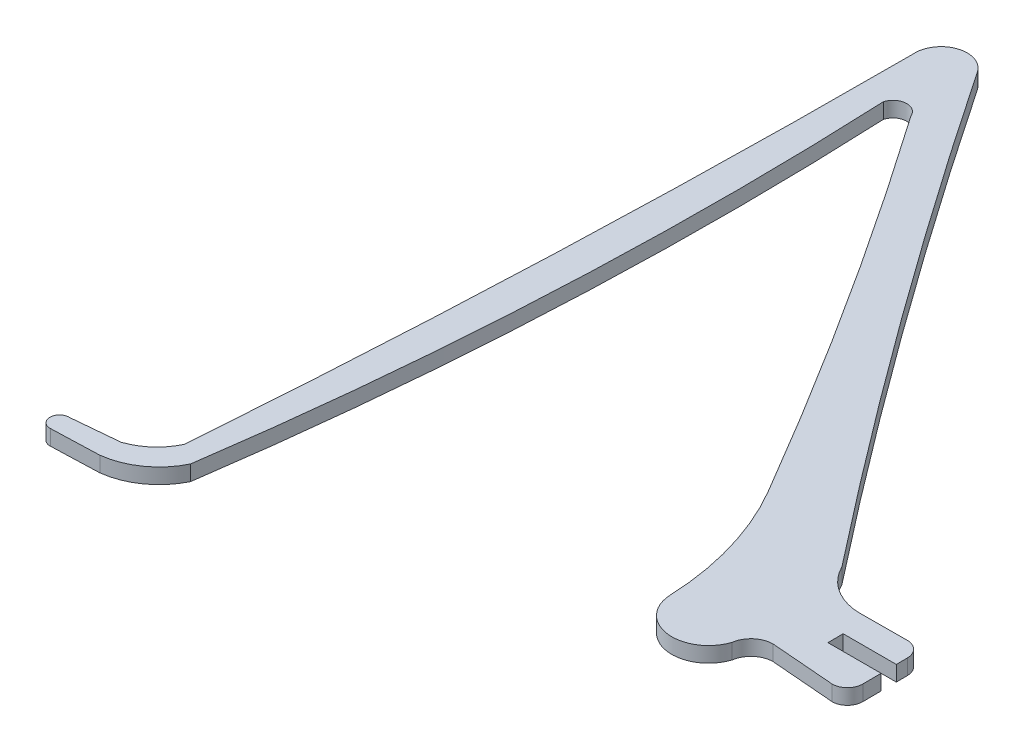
ISO-10303-21;
HEADER;
FILE_DESCRIPTION(('STEP AP214'),'2;1');
FILE_NAME('part.step','',(''),(''),'','','');
FILE_SCHEMA(('AUTOMOTIVE_DESIGN { 1 0 10303 214 1 1 1 1 }'));
ENDSEC;
DATA;
#1=APPLICATION_CONTEXT('core data for automotive mechanical design processes');
#2=APPLICATION_PROTOCOL_DEFINITION('international standard','automotive_design',2000,#1);
#3=PRODUCT_CONTEXT('',#1,'mechanical');
#4=PRODUCT('Part','Part','',(#3));
#5=PRODUCT_RELATED_PRODUCT_CATEGORY('part','',(#4));
#6=PRODUCT_DEFINITION_FORMATION('','',#4);
#7=PRODUCT_DEFINITION_CONTEXT('part definition',#1,'design');
#8=PRODUCT_DEFINITION('design','',#6,#7);
#9=PRODUCT_DEFINITION_SHAPE('','',#8);
#10=(LENGTH_UNIT() NAMED_UNIT(*) SI_UNIT(.MILLI.,.METRE.));
#11=(NAMED_UNIT(*) PLANE_ANGLE_UNIT() SI_UNIT($,.RADIAN.));
#12=(NAMED_UNIT(*) SI_UNIT($,.STERADIAN.) SOLID_ANGLE_UNIT());
#13=UNCERTAINTY_MEASURE_WITH_UNIT(LENGTH_MEASURE(1.E-05),#10,'distance_accuracy_value','');
#14=(GEOMETRIC_REPRESENTATION_CONTEXT(3) GLOBAL_UNCERTAINTY_ASSIGNED_CONTEXT((#13)) GLOBAL_UNIT_ASSIGNED_CONTEXT((#10,
#11,#12)) REPRESENTATION_CONTEXT('',''));
#15=CARTESIAN_POINT('',(0.,0.,0.));
#16=DIRECTION('',(0.,0.,1.));
#17=DIRECTION('',(1.,0.,0.));
#18=AXIS2_PLACEMENT_3D('',#15,#16,#17);
#19=CARTESIAN_POINT('',(-42136.1629241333,3.,-18247.0116923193));
#20=DIRECTION('',(0.,-1.,0.));
#21=DIRECTION('',(0.,0.,-1.));
#22=AXIS2_PLACEMENT_3D('',#19,#20,#21);
#23=CYLINDRICAL_SURFACE('',#22,13.2933695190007);
#24=CARTESIAN_POINT('',(-42136.1629241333,0.,-18247.0116923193));
#25=DIRECTION('',(0.,1.,0.));
#26=DIRECTION('',(0.,0.,1.));
#27=AXIS2_PLACEMENT_3D('',#24,#25,#26);
#28=CIRCLE('',#27,13.2933695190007);
#29=CARTESIAN_POINT('',(-42134.535156,0.,-18233.818359));
#30=VERTEX_POINT('',#29);
#31=CARTESIAN_POINT('',(-42124.20457,0.,-18241.205537));
#32=VERTEX_POINT('',#31);
#33=EDGE_CURVE('E228',#30,#32,#28,.T.);
#34=ORIENTED_EDGE('',*,*,#33,.T.);
#35=DIRECTION('',(0.,-1.,0.));
#36=VECTOR('',#35,1.);
#37=CARTESIAN_POINT('',(-42124.20457,3.,-18241.205537));
#38=LINE('',#37,#36);
#39=CARTESIAN_POINT('',(-42124.20457,3.,-18241.205537));
#40=VERTEX_POINT('',#39);
#41=EDGE_CURVE('E11',#40,#32,#38,.T.);
#42=ORIENTED_EDGE('',*,*,#41,.F.);
#43=CARTESIAN_POINT('',(-42136.1629241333,3.,-18247.0116923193));
#44=DIRECTION('',(0.,1.,0.));
#45=DIRECTION('',(0.,0.,1.));
#46=AXIS2_PLACEMENT_3D('',#43,#44,#45);
#47=CIRCLE('',#46,13.2933695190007);
#48=CARTESIAN_POINT('',(-42134.535156,3.,-18233.818359));
#49=VERTEX_POINT('',#48);
#50=EDGE_CURVE('E274',#49,#40,#47,.T.);
#51=ORIENTED_EDGE('',*,*,#50,.F.);
#52=DIRECTION('',(0.,-1.,0.));
#53=VECTOR('',#52,1.);
#54=CARTESIAN_POINT('',(-42134.535156,3.,-18233.818359));
#55=LINE('',#54,#53);
#56=EDGE_CURVE('E224',#49,#30,#55,.T.);
#57=ORIENTED_EDGE('',*,*,#56,.T.);
#58=EDGE_LOOP('',(#34,#42,#51,#57));
#59=FACE_BOUND('',#58,.T.);
#60=ADVANCED_FACE('F36',(#59),#23,.T.);
#61=CARTESIAN_POINT('',(-42799.5026352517,3.,-18339.4436125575));
#62=DIRECTION('',(0.,-1.,0.));
#63=DIRECTION('',(0.,0.,-1.));
#64=AXIS2_PLACEMENT_3D('',#61,#62,#63);
#65=CYLINDRICAL_SURFACE('',#64,682.406181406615);
#66=CARTESIAN_POINT('',(-42799.5026352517,0.,-18339.4436125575));
#67=DIRECTION('',(0.,1.,0.));
#68=DIRECTION('',(0.,0.,1.));
#69=AXIS2_PLACEMENT_3D('',#66,#67,#68);
#70=CIRCLE('',#69,682.406181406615);
#71=CARTESIAN_POINT('',(-42117.800619,0.,-18370.436474));
#72=VERTEX_POINT('',#71);
#73=EDGE_CURVE('E231',#32,#72,#70,.T.);
#74=ORIENTED_EDGE('',*,*,#73,.T.);
#75=DIRECTION('',(0.,-1.,0.));
#76=VECTOR('',#75,1.);
#77=CARTESIAN_POINT('',(-42117.800619,3.,-18370.436474));
#78=LINE('',#77,#76);
#79=CARTESIAN_POINT('',(-42117.800619,3.,-18370.436474));
#80=VERTEX_POINT('',#79);
#81=EDGE_CURVE('E44',#80,#72,#78,.T.);
#82=ORIENTED_EDGE('',*,*,#81,.F.);
#83=CARTESIAN_POINT('',(-42799.5026352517,3.,-18339.4436125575));
#84=DIRECTION('',(0.,1.,0.));
#85=DIRECTION('',(0.,0.,1.));
#86=AXIS2_PLACEMENT_3D('',#83,#84,#85);
#87=CIRCLE('',#86,682.406181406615);
#88=EDGE_CURVE('E143',#40,#80,#87,.T.);
#89=ORIENTED_EDGE('',*,*,#88,.F.);
#90=ORIENTED_EDGE('',*,*,#41,.T.);
#91=EDGE_LOOP('',(#74,#82,#89,#90));
#92=FACE_BOUND('',#91,.T.);
#93=ADVANCED_FACE('F412',(#92),#65,.T.);
#94=CARTESIAN_POINT('',(-42115.2010584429,3.,-18369.7403817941));
#95=DIRECTION('',(0.,-1.,0.));
#96=DIRECTION('',(0.,0.,-1.));
#97=AXIS2_PLACEMENT_3D('',#94,#95,#96);
#98=CYLINDRICAL_SURFACE('',#97,2.69114463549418);
#99=CARTESIAN_POINT('',(-42115.2010584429,0.,-18369.7403817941));
#100=DIRECTION('',(0.,-1.,0.));
#101=DIRECTION('',(0.,0.,1.));
#102=AXIS2_PLACEMENT_3D('',#99,#100,#101);
#103=CIRCLE('',#102,2.69114463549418);
#104=CARTESIAN_POINT('',(-42112.7270129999,0.,-18370.7993239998));
#105=VERTEX_POINT('',#104);
#106=EDGE_CURVE('E233',#72,#105,#103,.T.);
#107=ORIENTED_EDGE('',*,*,#106,.T.);
#108=DIRECTION('',(0.,-1.,0.));
#109=VECTOR('',#108,1.);
#110=CARTESIAN_POINT('',(-42112.7270129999,3.,-18370.7993239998));
#111=LINE('',#110,#109);
#112=CARTESIAN_POINT('',(-42112.7270129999,3.,-18370.7993239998));
#113=VERTEX_POINT('',#112);
#114=EDGE_CURVE('E329',#113,#105,#111,.T.);
#115=ORIENTED_EDGE('',*,*,#114,.F.);
#116=CARTESIAN_POINT('',(-42115.2010584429,3.,-18369.7403817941));
#117=DIRECTION('',(0.,-1.,0.));
#118=DIRECTION('',(0.,0.,1.));
#119=AXIS2_PLACEMENT_3D('',#116,#117,#118);
#120=CIRCLE('',#119,2.69114463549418);
#121=EDGE_CURVE('E337',#80,#113,#120,.T.);
#122=ORIENTED_EDGE('',*,*,#121,.F.);
#123=ORIENTED_EDGE('',*,*,#81,.T.);
#124=EDGE_LOOP('',(#107,#115,#122,#123));
#125=FACE_BOUND('',#124,.T.);
#126=ADVANCED_FACE('F335',(#125),#98,.F.);
#127=CARTESIAN_POINT('',(-43045.39922722,3.,-17718.987308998));
#128=DIRECTION('',(0.,-1.,0.));
#129=DIRECTION('',(0.,0.,-1.));
#130=AXIS2_PLACEMENT_3D('',#127,#128,#129);
#131=CYLINDRICAL_SURFACE('',#130,1137.8648259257);
#132=CARTESIAN_POINT('',(-43045.39922722,0.,-17718.987308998));
#133=DIRECTION('',(0.,-1.,0.));
#134=DIRECTION('',(0.,0.,1.));
#135=AXIS2_PLACEMENT_3D('',#132,#133,#134);
#136=CIRCLE('',#135,1137.8648259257);
#137=CARTESIAN_POINT('',(-42062.969694,0.,-18293.0679429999));
#138=VERTEX_POINT('',#137);
#139=EDGE_CURVE('E235',#105,#138,#136,.T.);
#140=ORIENTED_EDGE('',*,*,#139,.T.);
#141=DIRECTION('',(0.,-1.,0.));
#142=VECTOR('',#141,1.);
#143=CARTESIAN_POINT('',(-42062.969694,3.,-18293.0679429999));
#144=LINE('',#143,#142);
#145=CARTESIAN_POINT('',(-42062.969694,3.,-18293.0679429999));
#146=VERTEX_POINT('',#145);
#147=EDGE_CURVE('E326',#146,#138,#144,.T.);
#148=ORIENTED_EDGE('',*,*,#147,.F.);
#149=CARTESIAN_POINT('',(-43045.39922722,3.,-17718.987308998));
#150=DIRECTION('',(0.,-1.,0.));
#151=DIRECTION('',(0.,0.,1.));
#152=AXIS2_PLACEMENT_3D('',#149,#150,#151);
#153=CIRCLE('',#152,1137.8648259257);
#154=EDGE_CURVE('E355',#113,#146,#153,.T.);
#155=ORIENTED_EDGE('',*,*,#154,.F.);
#156=ORIENTED_EDGE('',*,*,#114,.T.);
#157=EDGE_LOOP('',(#140,#148,#155,#156));
#158=FACE_BOUND('',#157,.T.);
#159=ADVANCED_FACE('F346',(#158),#131,.F.);
#160=CARTESIAN_POINT('',(-42113.6161511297,3.,-18263.4671733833));
#161=DIRECTION('',(0.,-1.,0.));
#162=DIRECTION('',(0.,0.,-1.));
#163=AXIS2_PLACEMENT_3D('',#160,#161,#162);
#164=CYLINDRICAL_SURFACE('',#163,58.6623318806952);
#165=CARTESIAN_POINT('',(-42113.6161511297,0.,-18263.4671733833));
#166=DIRECTION('',(0.,-1.,0.));
#167=DIRECTION('',(0.,0.,1.));
#168=AXIS2_PLACEMENT_3D('',#165,#166,#167);
#169=CIRCLE('',#168,58.6623318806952);
#170=CARTESIAN_POINT('',(-42055.005587,0.,-18265.931104));
#171=VERTEX_POINT('',#170);
#172=EDGE_CURVE('E237',#138,#171,#169,.T.);
#173=ORIENTED_EDGE('',*,*,#172,.T.);
#174=DIRECTION('',(0.,-1.,0.));
#175=VECTOR('',#174,1.);
#176=CARTESIAN_POINT('',(-42055.005587,3.,-18265.931104));
#177=LINE('',#176,#175);
#178=CARTESIAN_POINT('',(-42055.005587,3.,-18265.931104));
#179=VERTEX_POINT('',#178);
#180=EDGE_CURVE('E323',#179,#171,#177,.T.);
#181=ORIENTED_EDGE('',*,*,#180,.F.);
#182=CARTESIAN_POINT('',(-42113.6161511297,3.,-18263.4671733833));
#183=DIRECTION('',(0.,-1.,0.));
#184=DIRECTION('',(0.,0.,1.));
#185=AXIS2_PLACEMENT_3D('',#182,#183,#184);
#186=CIRCLE('',#185,58.6623318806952);
#187=EDGE_CURVE('E352',#146,#179,#186,.T.);
#188=ORIENTED_EDGE('',*,*,#187,.F.);
#189=ORIENTED_EDGE('',*,*,#147,.T.);
#190=EDGE_LOOP('',(#173,#181,#188,#189));
#191=FACE_BOUND('',#190,.T.);
#192=ADVANCED_FACE('F350',(#191),#164,.F.);
#193=CARTESIAN_POINT('',(-42047.7937259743,3.,-18266.2344820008));
#194=DIRECTION('',(0.,-1.,0.));
#195=DIRECTION('',(0.,0.,-1.));
#196=AXIS2_PLACEMENT_3D('',#193,#194,#195);
#197=CYLINDRICAL_SURFACE('',#196,7.21823923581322);
#198=CARTESIAN_POINT('',(-42047.7937259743,0.,-18266.2344820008));
#199=DIRECTION('',(0.,1.,0.));
#200=DIRECTION('',(0.,0.,1.));
#201=AXIS2_PLACEMENT_3D('',#198,#199,#200);
#202=CIRCLE('',#201,7.21823923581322);
#203=CARTESIAN_POINT('',(-42040.948503,0.,-18263.944089));
#204=VERTEX_POINT('',#203);
#205=EDGE_CURVE('E239',#171,#204,#202,.T.);
#206=ORIENTED_EDGE('',*,*,#205,.T.);
#207=DIRECTION('',(0.,-1.,0.));
#208=VECTOR('',#207,1.);
#209=CARTESIAN_POINT('',(-42040.948503,3.,-18263.944089));
#210=LINE('',#209,#208);
#211=CARTESIAN_POINT('',(-42040.948503,3.,-18263.944089));
#212=VERTEX_POINT('',#211);
#213=EDGE_CURVE('E320',#212,#204,#210,.T.);
#214=ORIENTED_EDGE('',*,*,#213,.F.);
#215=CARTESIAN_POINT('',(-42047.7937259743,3.,-18266.2344820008));
#216=DIRECTION('',(0.,1.,0.));
#217=DIRECTION('',(0.,0.,1.));
#218=AXIS2_PLACEMENT_3D('',#215,#216,#217);
#219=CIRCLE('',#218,7.21823923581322);
#220=EDGE_CURVE('E354',#179,#212,#219,.T.);
#221=ORIENTED_EDGE('',*,*,#220,.F.);
#222=ORIENTED_EDGE('',*,*,#180,.T.);
#223=EDGE_LOOP('',(#206,#214,#221,#222));
#224=FACE_BOUND('',#223,.T.);
#225=ADVANCED_FACE('F425',(#224),#197,.T.);
#226=CARTESIAN_POINT('',(-42036.6327541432,3.,-18263.357472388));
#227=DIRECTION('',(0.,-1.,0.));
#228=DIRECTION('',(0.,0.,-1.));
#229=AXIS2_PLACEMENT_3D('',#226,#227,#228);
#230=CYLINDRICAL_SURFACE('',#229,4.35543421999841);
#231=CARTESIAN_POINT('',(-42036.6327541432,0.,-18263.357472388));
#232=DIRECTION('',(0.,-1.,0.));
#233=DIRECTION('',(0.,0.,1.));
#234=AXIS2_PLACEMENT_3D('',#231,#232,#233);
#235=CIRCLE('',#234,4.35543421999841);
#236=CARTESIAN_POINT('',(-42036.621094,0.,-18267.712891));
#237=VERTEX_POINT('',#236);
#238=EDGE_CURVE('E241',#204,#237,#235,.T.);
#239=ORIENTED_EDGE('',*,*,#238,.T.);
#240=DIRECTION('',(0.,-1.,0.));
#241=VECTOR('',#240,1.);
#242=CARTESIAN_POINT('',(-42036.621094,3.,-18267.712891));
#243=LINE('',#242,#241);
#244=CARTESIAN_POINT('',(-42036.621094,3.,-18267.712891));
#245=VERTEX_POINT('',#244);
#246=EDGE_CURVE('E317',#245,#237,#243,.T.);
#247=ORIENTED_EDGE('',*,*,#246,.F.);
#248=CARTESIAN_POINT('',(-42036.6327541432,3.,-18263.357472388));
#249=DIRECTION('',(0.,-1.,0.));
#250=DIRECTION('',(0.,0.,1.));
#251=AXIS2_PLACEMENT_3D('',#248,#249,#250);
#252=CIRCLE('',#251,4.35543421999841);
#253=EDGE_CURVE('E357',#212,#245,#252,.T.);
#254=ORIENTED_EDGE('',*,*,#253,.F.);
#255=ORIENTED_EDGE('',*,*,#213,.T.);
#256=EDGE_LOOP('',(#239,#247,#254,#255));
#257=FACE_BOUND('',#256,.T.);
#258=ADVANCED_FACE('F428',(#257),#230,.F.);
#259=CARTESIAN_POINT('',(-42024.054306,3.,-18266.695379));
#260=DIRECTION('',(0.0807042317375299,0.,-0.996738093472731));
#261=DIRECTION('',(-0.996738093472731,0.,-0.08070423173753));
#262=AXIS2_PLACEMENT_3D('',#259,#260,#261);
#263=PLANE('',#262);
#264=DIRECTION('',(0.996738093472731,0.,0.0807042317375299));
#265=VECTOR('',#264,1.);
#266=CARTESIAN_POINT('',(-42024.054306,0.,-18266.695379));
#267=LINE('',#266,#265);
#268=CARTESIAN_POINT('',(-42024.054306,0.,-18266.695379));
#269=VERTEX_POINT('',#268);
#270=EDGE_CURVE('E243',#237,#269,#267,.T.);
#271=ORIENTED_EDGE('',*,*,#270,.T.);
#272=DIRECTION('',(0.,-1.,0.));
#273=VECTOR('',#272,1.);
#274=CARTESIAN_POINT('',(-42024.054306,3.,-18266.695379));
#275=LINE('',#274,#273);
#276=CARTESIAN_POINT('',(-42024.054306,3.,-18266.695379));
#277=VERTEX_POINT('',#276);
#278=EDGE_CURVE('E314',#277,#269,#275,.T.);
#279=ORIENTED_EDGE('',*,*,#278,.F.);
#280=DIRECTION('',(0.996738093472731,0.,0.0807042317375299));
#281=VECTOR('',#280,1.);
#282=CARTESIAN_POINT('',(-42024.054306,3.,-18266.695379));
#283=LINE('',#282,#281);
#284=EDGE_CURVE('E363',#245,#277,#283,.T.);
#285=ORIENTED_EDGE('',*,*,#284,.F.);
#286=ORIENTED_EDGE('',*,*,#246,.T.);
#287=EDGE_LOOP('',(#271,#279,#285,#286));
#288=FACE_BOUND('',#287,.T.);
#289=ADVANCED_FACE('F432',(#288),#263,.F.);
#290=CARTESIAN_POINT('',(-42024.0761180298,3.,-18269.6933841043));
#291=DIRECTION('',(0.,-1.,0.));
#292=DIRECTION('',(0.,0.,-1.));
#293=AXIS2_PLACEMENT_3D('',#290,#291,#292);
#294=CYLINDRICAL_SURFACE('',#293,2.99808445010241);
#295=CARTESIAN_POINT('',(-42024.0761180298,0.,-18269.6933841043));
#296=DIRECTION('',(0.,1.,0.));
#297=DIRECTION('',(0.,0.,1.));
#298=AXIS2_PLACEMENT_3D('',#295,#296,#297);
#299=CIRCLE('',#298,2.99808445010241);
#300=CARTESIAN_POINT('',(-42021.0781250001,0.,-18269.716797));
#301=VERTEX_POINT('',#300);
#302=EDGE_CURVE('E245',#269,#301,#299,.T.);
#303=ORIENTED_EDGE('',*,*,#302,.T.);
#304=DIRECTION('',(0.,-1.,0.));
#305=VECTOR('',#304,1.);
#306=CARTESIAN_POINT('',(-42021.0781250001,3.,-18269.716797));
#307=LINE('',#306,#305);
#308=CARTESIAN_POINT('',(-42021.0781250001,3.,-18269.716797));
#309=VERTEX_POINT('',#308);
#310=EDGE_CURVE('E311',#309,#301,#307,.T.);
#311=ORIENTED_EDGE('',*,*,#310,.F.);
#312=CARTESIAN_POINT('',(-42024.0761180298,3.,-18269.6933841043));
#313=DIRECTION('',(0.,1.,0.));
#314=DIRECTION('',(0.,0.,1.));
#315=AXIS2_PLACEMENT_3D('',#312,#313,#314);
#316=CIRCLE('',#315,2.99808445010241);
#317=EDGE_CURVE('E365',#277,#309,#316,.T.);
#318=ORIENTED_EDGE('',*,*,#317,.F.);
#319=ORIENTED_EDGE('',*,*,#278,.T.);
#320=EDGE_LOOP('',(#303,#311,#318,#319));
#321=FACE_BOUND('',#320,.T.);
#322=ADVANCED_FACE('F436',(#321),#294,.T.);
#323=CARTESIAN_POINT('',(-42021.101562,3.,-18273.310547));
#324=DIRECTION('',(-0.999978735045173,0.,0.00652146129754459));
#325=DIRECTION('',(0.0065214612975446,0.,0.999978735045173));
#326=AXIS2_PLACEMENT_3D('',#323,#324,#325);
#327=PLANE('',#326);
#328=DIRECTION('',(-0.0065214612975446,0.,-0.999978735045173));
#329=VECTOR('',#328,1.);
#330=CARTESIAN_POINT('',(-42021.101562,0.,-18273.310547));
#331=LINE('',#330,#329);
#332=CARTESIAN_POINT('',(-42021.101562,0.,-18273.310547));
#333=VERTEX_POINT('',#332);
#334=EDGE_CURVE('E247',#301,#333,#331,.T.);
#335=ORIENTED_EDGE('',*,*,#334,.T.);
#336=DIRECTION('',(0.,-1.,0.));
#337=VECTOR('',#336,1.);
#338=CARTESIAN_POINT('',(-42021.101562,3.,-18273.310547));
#339=LINE('',#338,#337);
#340=CARTESIAN_POINT('',(-42021.101562,3.,-18273.310547));
#341=VERTEX_POINT('',#340);
#342=EDGE_CURVE('E308',#341,#333,#339,.T.);
#343=ORIENTED_EDGE('',*,*,#342,.F.);
#344=DIRECTION('',(-0.0065214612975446,0.,-0.999978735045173));
#345=VECTOR('',#344,1.);
#346=CARTESIAN_POINT('',(-42021.101562,3.,-18273.310547));
#347=LINE('',#346,#345);
#348=EDGE_CURVE('E367',#309,#341,#347,.T.);
#349=ORIENTED_EDGE('',*,*,#348,.F.);
#350=ORIENTED_EDGE('',*,*,#310,.T.);
#351=EDGE_LOOP('',(#335,#343,#349,#350));
#352=FACE_BOUND('',#351,.T.);
#353=ADVANCED_FACE('F440',(#352),#327,.F.);
#354=CARTESIAN_POINT('',(-42031.503906,3.,-18273.308594));
#355=DIRECTION('',(0.000187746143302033,0.,0.999999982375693));
#356=DIRECTION('',(0.999999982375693,0.,-0.000187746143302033));
#357=AXIS2_PLACEMENT_3D('',#354,#355,#356);
#358=PLANE('',#357);
#359=DIRECTION('',(-0.999999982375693,0.,0.000187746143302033));
#360=VECTOR('',#359,1.);
#361=CARTESIAN_POINT('',(-42031.503906,0.,-18273.308594));
#362=LINE('',#361,#360);
#363=CARTESIAN_POINT('',(-42031.503906,0.,-18273.308594));
#364=VERTEX_POINT('',#363);
#365=EDGE_CURVE('E249',#333,#364,#362,.T.);
#366=ORIENTED_EDGE('',*,*,#365,.T.);
#367=DIRECTION('',(0.,-1.,0.));
#368=VECTOR('',#367,1.);
#369=CARTESIAN_POINT('',(-42031.503906,3.,-18273.308594));
#370=LINE('',#369,#368);
#371=CARTESIAN_POINT('',(-42031.503906,3.,-18273.308594));
#372=VERTEX_POINT('',#371);
#373=EDGE_CURVE('E305',#372,#364,#370,.T.);
#374=ORIENTED_EDGE('',*,*,#373,.F.);
#375=DIRECTION('',(-0.999999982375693,0.,0.000187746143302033));
#376=VECTOR('',#375,1.);
#377=CARTESIAN_POINT('',(-42031.503906,3.,-18273.308594));
#378=LINE('',#377,#376);
#379=EDGE_CURVE('E369',#341,#372,#378,.T.);
#380=ORIENTED_EDGE('',*,*,#379,.F.);
#381=ORIENTED_EDGE('',*,*,#342,.T.);
#382=EDGE_LOOP('',(#366,#374,#380,#381));
#383=FACE_BOUND('',#382,.T.);
#384=ADVANCED_FACE('F444',(#383),#358,.F.);
#385=CARTESIAN_POINT('',(-42031.527344,3.,-18276.308594));
#386=DIRECTION('',(-0.999969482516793,0.,0.00781242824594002));
#387=DIRECTION('',(0.00781242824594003,0.,0.999969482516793));
#388=AXIS2_PLACEMENT_3D('',#385,#386,#387);
#389=PLANE('',#388);
#390=DIRECTION('',(-0.00781242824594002,0.,-0.999969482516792));
#391=VECTOR('',#390,1.);
#392=CARTESIAN_POINT('',(-42031.527344,0.,-18276.308594));
#393=LINE('',#392,#391);
#394=CARTESIAN_POINT('',(-42031.527344,0.,-18276.308594));
#395=VERTEX_POINT('',#394);
#396=EDGE_CURVE('E251',#364,#395,#393,.T.);
#397=ORIENTED_EDGE('',*,*,#396,.T.);
#398=DIRECTION('',(0.,-1.,0.));
#399=VECTOR('',#398,1.);
#400=CARTESIAN_POINT('',(-42031.527344,3.,-18276.308594));
#401=LINE('',#400,#399);
#402=CARTESIAN_POINT('',(-42031.527344,3.,-18276.308594));
#403=VERTEX_POINT('',#402);
#404=EDGE_CURVE('E302',#403,#395,#401,.T.);
#405=ORIENTED_EDGE('',*,*,#404,.F.);
#406=DIRECTION('',(-0.00781242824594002,0.,-0.999969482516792));
#407=VECTOR('',#406,1.);
#408=CARTESIAN_POINT('',(-42031.527344,3.,-18276.308594));
#409=LINE('',#408,#407);
#410=EDGE_CURVE('E371',#372,#403,#409,.T.);
#411=ORIENTED_EDGE('',*,*,#410,.F.);
#412=ORIENTED_EDGE('',*,*,#373,.T.);
#413=EDGE_LOOP('',(#397,#405,#411,#412));
#414=FACE_BOUND('',#413,.T.);
#415=ADVANCED_FACE('F448',(#414),#389,.F.);
#416=CARTESIAN_POINT('',(-42021.117187,3.,-18276.308594));
#417=DIRECTION('',(0.,0.,-1.));
#418=DIRECTION('',(-1.,0.,0.));
#419=AXIS2_PLACEMENT_3D('',#416,#417,#418);
#420=PLANE('',#419);
#421=DIRECTION('',(1.,0.,0.));
#422=VECTOR('',#421,1.);
#423=CARTESIAN_POINT('',(-42021.117187,0.,-18276.308594));
#424=LINE('',#423,#422);
#425=CARTESIAN_POINT('',(-42021.117187,0.,-18276.308594));
#426=VERTEX_POINT('',#425);
#427=EDGE_CURVE('E253',#395,#426,#424,.T.);
#428=ORIENTED_EDGE('',*,*,#427,.T.);
#429=DIRECTION('',(0.,-1.,0.));
#430=VECTOR('',#429,1.);
#431=CARTESIAN_POINT('',(-42021.117187,3.,-18276.308594));
#432=LINE('',#431,#430);
#433=CARTESIAN_POINT('',(-42021.117187,3.,-18276.308594));
#434=VERTEX_POINT('',#433);
#435=EDGE_CURVE('E299',#434,#426,#432,.T.);
#436=ORIENTED_EDGE('',*,*,#435,.F.);
#437=DIRECTION('',(1.,0.,0.));
#438=VECTOR('',#437,1.);
#439=CARTESIAN_POINT('',(-42021.117187,3.,-18276.308594));
#440=LINE('',#439,#438);
#441=EDGE_CURVE('E373',#403,#434,#440,.T.);
#442=ORIENTED_EDGE('',*,*,#441,.F.);
#443=ORIENTED_EDGE('',*,*,#404,.T.);
#444=EDGE_LOOP('',(#428,#436,#442,#443));
#445=FACE_BOUND('',#444,.T.);
#446=ADVANCED_FACE('F452',(#445),#420,.F.);
#447=CARTESIAN_POINT('',(-42021.132872,3.,-18278.491515));
#448=DIRECTION('',(-0.999974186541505,0.,0.0071851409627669));
#449=DIRECTION('',(0.0071851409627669,0.,0.999974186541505));
#450=AXIS2_PLACEMENT_3D('',#447,#448,#449);
#451=PLANE('',#450);
#452=DIRECTION('',(-0.0071851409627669,0.,-0.999974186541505));
#453=VECTOR('',#452,1.);
#454=CARTESIAN_POINT('',(-42021.132872,0.,-18278.491515));
#455=LINE('',#454,#453);
#456=CARTESIAN_POINT('',(-42021.132872,0.,-18278.491515));
#457=VERTEX_POINT('',#456);
#458=EDGE_CURVE('E255',#426,#457,#455,.T.);
#459=ORIENTED_EDGE('',*,*,#458,.T.);
#460=DIRECTION('',(0.,-1.,0.));
#461=VECTOR('',#460,1.);
#462=CARTESIAN_POINT('',(-42021.132872,3.,-18278.491515));
#463=LINE('',#462,#461);
#464=CARTESIAN_POINT('',(-42021.132872,3.,-18278.491515));
#465=VERTEX_POINT('',#464);
#466=EDGE_CURVE('E296',#465,#457,#463,.T.);
#467=ORIENTED_EDGE('',*,*,#466,.F.);
#468=DIRECTION('',(-0.0071851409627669,0.,-0.999974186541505));
#469=VECTOR('',#468,1.);
#470=CARTESIAN_POINT('',(-42021.132872,3.,-18278.491515));
#471=LINE('',#470,#469);
#472=EDGE_CURVE('E375',#434,#465,#471,.T.);
#473=ORIENTED_EDGE('',*,*,#472,.F.);
#474=ORIENTED_EDGE('',*,*,#435,.T.);
#475=EDGE_LOOP('',(#459,#467,#473,#474));
#476=FACE_BOUND('',#475,.T.);
#477=ADVANCED_FACE('F456',(#476),#451,.F.);
#478=CARTESIAN_POINT('',(-42024.1348082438,3.,-18278.4746294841));
#479=DIRECTION('',(0.,-1.,0.));
#480=DIRECTION('',(0.,0.,-1.));
#481=AXIS2_PLACEMENT_3D('',#478,#479,#480);
#482=CYLINDRICAL_SURFACE('',#481,3.00198373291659);
#483=CARTESIAN_POINT('',(-42024.1348082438,0.,-18278.4746294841));
#484=DIRECTION('',(0.,1.,0.));
#485=DIRECTION('',(0.,0.,1.));
#486=AXIS2_PLACEMENT_3D('',#483,#484,#485);
#487=CIRCLE('',#486,3.00198373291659);
#488=CARTESIAN_POINT('',(-42024.152344,0.,-18281.476562));
#489=VERTEX_POINT('',#488);
#490=EDGE_CURVE('E257',#457,#489,#487,.T.);
#491=ORIENTED_EDGE('',*,*,#490,.T.);
#492=DIRECTION('',(0.,-1.,0.));
#493=VECTOR('',#492,1.);
#494=CARTESIAN_POINT('',(-42024.152344,3.,-18281.476562));
#495=LINE('',#494,#493);
#496=CARTESIAN_POINT('',(-42024.152344,3.,-18281.476562));
#497=VERTEX_POINT('',#496);
#498=EDGE_CURVE('E293',#497,#489,#495,.T.);
#499=ORIENTED_EDGE('',*,*,#498,.F.);
#500=CARTESIAN_POINT('',(-42024.1348082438,3.,-18278.4746294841));
#501=DIRECTION('',(0.,1.,0.));
#502=DIRECTION('',(0.,0.,1.));
#503=AXIS2_PLACEMENT_3D('',#500,#501,#502);
#504=CIRCLE('',#503,3.00198373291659);
#505=EDGE_CURVE('E377',#465,#497,#504,.T.);
#506=ORIENTED_EDGE('',*,*,#505,.F.);
#507=ORIENTED_EDGE('',*,*,#466,.T.);
#508=EDGE_LOOP('',(#491,#499,#506,#507));
#509=FACE_BOUND('',#508,.T.);
#510=ADVANCED_FACE('F460',(#509),#482,.T.);
#511=CARTESIAN_POINT('',(-42033.452371,3.,-18281.420521));
#512=DIRECTION('',(0.00602578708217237,0.,0.999981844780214));
#513=DIRECTION('',(0.999981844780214,0.,-0.00602578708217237));
#514=AXIS2_PLACEMENT_3D('',#511,#512,#513);
#515=PLANE('',#514);
#516=DIRECTION('',(-0.999981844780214,0.,0.00602578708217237));
#517=VECTOR('',#516,1.);
#518=CARTESIAN_POINT('',(-42033.452371,0.,-18281.420521));
#519=LINE('',#518,#517);
#520=CARTESIAN_POINT('',(-42033.452371,0.,-18281.420521));
#521=VERTEX_POINT('',#520);
#522=EDGE_CURVE('E259',#489,#521,#519,.T.);
#523=ORIENTED_EDGE('',*,*,#522,.T.);
#524=DIRECTION('',(0.,-1.,0.));
#525=VECTOR('',#524,1.);
#526=CARTESIAN_POINT('',(-42033.452371,3.,-18281.420521));
#527=LINE('',#526,#525);
#528=CARTESIAN_POINT('',(-42033.452371,3.,-18281.420521));
#529=VERTEX_POINT('',#528);
#530=EDGE_CURVE('E290',#529,#521,#527,.T.);
#531=ORIENTED_EDGE('',*,*,#530,.F.);
#532=DIRECTION('',(-0.999981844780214,0.,0.00602578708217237));
#533=VECTOR('',#532,1.);
#534=CARTESIAN_POINT('',(-42033.452371,3.,-18281.420521));
#535=LINE('',#534,#533);
#536=EDGE_CURVE('E379',#497,#529,#535,.T.);
#537=ORIENTED_EDGE('',*,*,#536,.F.);
#538=ORIENTED_EDGE('',*,*,#498,.T.);
#539=EDGE_LOOP('',(#523,#531,#537,#538));
#540=FACE_BOUND('',#539,.T.);
#541=ADVANCED_FACE('F464',(#540),#515,.F.);
#542=CARTESIAN_POINT('',(-42033.2245608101,3.,-18292.2746570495));
#543=DIRECTION('',(0.,-1.,0.));
#544=DIRECTION('',(0.,0.,-1.));
#545=AXIS2_PLACEMENT_3D('',#542,#543,#544);
#546=CYLINDRICAL_SURFACE('',#545,10.856526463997);
#547=CARTESIAN_POINT('',(-42033.2245608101,0.,-18292.2746570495));
#548=DIRECTION('',(0.,-1.,0.));
#549=DIRECTION('',(0.,0.,1.));
#550=AXIS2_PLACEMENT_3D('',#547,#548,#549);
#551=CIRCLE('',#550,10.856526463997);
#552=CARTESIAN_POINT('',(-42042.9887739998,0.,-18287.5286789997));
#553=VERTEX_POINT('',#552);
#554=EDGE_CURVE('E261',#521,#553,#551,.T.);
#555=ORIENTED_EDGE('',*,*,#554,.T.);
#556=DIRECTION('',(0.,-1.,0.));
#557=VECTOR('',#556,1.);
#558=CARTESIAN_POINT('',(-42042.9887739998,3.,-18287.5286789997));
#559=LINE('',#558,#557);
#560=CARTESIAN_POINT('',(-42042.9887739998,3.,-18287.5286789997));
#561=VERTEX_POINT('',#560);
#562=EDGE_CURVE('E287',#561,#553,#559,.T.);
#563=ORIENTED_EDGE('',*,*,#562,.F.);
#564=CARTESIAN_POINT('',(-42033.2245608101,3.,-18292.2746570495));
#565=DIRECTION('',(0.,-1.,0.));
#566=DIRECTION('',(0.,0.,1.));
#567=AXIS2_PLACEMENT_3D('',#564,#565,#566);
#568=CIRCLE('',#567,10.856526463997);
#569=EDGE_CURVE('E381',#529,#561,#568,.T.);
#570=ORIENTED_EDGE('',*,*,#569,.F.);
#571=ORIENTED_EDGE('',*,*,#530,.T.);
#572=EDGE_LOOP('',(#555,#563,#570,#571));
#573=FACE_BOUND('',#572,.T.);
#574=ADVANCED_FACE('F468',(#573),#546,.F.);
#575=CARTESIAN_POINT('',(-40781.9142322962,3.,-19278.6638095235));
#576=DIRECTION('',(0.,-1.,0.));
#577=DIRECTION('',(0.,0.,-1.));
#578=AXIS2_PLACEMENT_3D('',#575,#576,#577);
#579=CYLINDRICAL_SURFACE('',#578,1603.9506995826);
#580=CARTESIAN_POINT('',(-40781.9142322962,0.,-19278.6638095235));
#581=DIRECTION('',(0.,-1.,0.));
#582=DIRECTION('',(0.,0.,1.));
#583=AXIS2_PLACEMENT_3D('',#580,#581,#582);
#584=CIRCLE('',#583,1603.9506995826);
#585=CARTESIAN_POINT('',(-42113.6243129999,0.,-18384.680528));
#586=VERTEX_POINT('',#585);
#587=EDGE_CURVE('E263',#553,#586,#584,.T.);
#588=ORIENTED_EDGE('',*,*,#587,.T.);
#589=DIRECTION('',(0.,-1.,0.));
#590=VECTOR('',#589,1.);
#591=CARTESIAN_POINT('',(-42113.6243129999,3.,-18384.680528));
#592=LINE('',#591,#590);
#593=CARTESIAN_POINT('',(-42113.6243129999,3.,-18384.680528));
#594=VERTEX_POINT('',#593);
#595=EDGE_CURVE('E284',#594,#586,#592,.T.);
#596=ORIENTED_EDGE('',*,*,#595,.F.);
#597=CARTESIAN_POINT('',(-40781.9142322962,3.,-19278.6638095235));
#598=DIRECTION('',(0.,-1.,0.));
#599=DIRECTION('',(0.,0.,1.));
#600=AXIS2_PLACEMENT_3D('',#597,#598,#599);
#601=CIRCLE('',#600,1603.9506995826);
#602=EDGE_CURVE('E383',#561,#594,#601,.T.);
#603=ORIENTED_EDGE('',*,*,#602,.F.);
#604=ORIENTED_EDGE('',*,*,#562,.T.);
#605=EDGE_LOOP('',(#588,#596,#603,#604));
#606=FACE_BOUND('',#605,.T.);
#607=ADVANCED_FACE('F472',(#606),#579,.F.);
#608=CARTESIAN_POINT('',(-42117.8760857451,3.,-18381.8277422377));
#609=DIRECTION('',(0.,-1.,0.));
#610=DIRECTION('',(0.,0.,-1.));
#611=AXIS2_PLACEMENT_3D('',#608,#609,#610);
#612=CYLINDRICAL_SURFACE('',#611,5.12015215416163);
#613=CARTESIAN_POINT('',(-42117.8760857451,0.,-18381.8277422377));
#614=DIRECTION('',(0.,1.,0.));
#615=DIRECTION('',(0.,0.,1.));
#616=AXIS2_PLACEMENT_3D('',#613,#614,#615);
#617=CIRCLE('',#616,5.12015215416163);
#618=CARTESIAN_POINT('',(-42122.976922,0.,-18381.3834140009));
#619=VERTEX_POINT('',#618);
#620=EDGE_CURVE('E265',#586,#619,#617,.T.);
#621=ORIENTED_EDGE('',*,*,#620,.T.);
#622=DIRECTION('',(0.,-1.,0.));
#623=VECTOR('',#622,1.);
#624=CARTESIAN_POINT('',(-42122.976922,3.,-18381.3834140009));
#625=LINE('',#624,#623);
#626=CARTESIAN_POINT('',(-42122.976922,3.,-18381.3834140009));
#627=VERTEX_POINT('',#626);
#628=EDGE_CURVE('E281',#627,#619,#625,.T.);
#629=ORIENTED_EDGE('',*,*,#628,.F.);
#630=CARTESIAN_POINT('',(-42117.8760857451,3.,-18381.8277422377));
#631=DIRECTION('',(0.,1.,0.));
#632=DIRECTION('',(0.,0.,1.));
#633=AXIS2_PLACEMENT_3D('',#630,#631,#632);
#634=CIRCLE('',#633,5.12015215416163);
#635=EDGE_CURVE('E385',#594,#627,#634,.T.);
#636=ORIENTED_EDGE('',*,*,#635,.F.);
#637=ORIENTED_EDGE('',*,*,#595,.T.);
#638=EDGE_LOOP('',(#621,#629,#636,#637));
#639=FACE_BOUND('',#638,.T.);
#640=ADVANCED_FACE('F476',(#639),#612,.T.);
#641=CARTESIAN_POINT('',(-43893.4192093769,3.,-18379.0783183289));
#642=DIRECTION('',(0.,-1.,0.));
#643=DIRECTION('',(0.,0.,-1.));
#644=AXIS2_PLACEMENT_3D('',#641,#642,#643);
#645=CYLINDRICAL_SURFACE('',#644,1770.4437879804);
#646=CARTESIAN_POINT('',(-43893.4192093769,0.,-18379.0783183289));
#647=DIRECTION('',(0.,-1.,0.));
#648=DIRECTION('',(0.,0.,1.));
#649=AXIS2_PLACEMENT_3D('',#646,#647,#648);
#650=CIRCLE('',#649,1770.4437879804);
#651=CARTESIAN_POINT('',(-42128.142478,0.,-18243.9144620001));
#652=VERTEX_POINT('',#651);
#653=EDGE_CURVE('E267',#619,#652,#650,.T.);
#654=ORIENTED_EDGE('',*,*,#653,.T.);
#655=DIRECTION('',(0.,-1.,0.));
#656=VECTOR('',#655,1.);
#657=CARTESIAN_POINT('',(-42128.142478,3.,-18243.9144620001));
#658=LINE('',#657,#656);
#659=CARTESIAN_POINT('',(-42128.142478,3.,-18243.9144620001));
#660=VERTEX_POINT('',#659);
#661=EDGE_CURVE('E278',#660,#652,#658,.T.);
#662=ORIENTED_EDGE('',*,*,#661,.F.);
#663=CARTESIAN_POINT('',(-43893.4192093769,3.,-18379.0783183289));
#664=DIRECTION('',(0.,-1.,0.));
#665=DIRECTION('',(0.,0.,1.));
#666=AXIS2_PLACEMENT_3D('',#663,#664,#665);
#667=CIRCLE('',#666,1770.4437879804);
#668=EDGE_CURVE('E387',#627,#660,#667,.T.);
#669=ORIENTED_EDGE('',*,*,#668,.F.);
#670=ORIENTED_EDGE('',*,*,#628,.T.);
#671=EDGE_LOOP('',(#654,#662,#669,#670));
#672=FACE_BOUND('',#671,.T.);
#673=ADVANCED_FACE('F393',(#672),#645,.F.);
#674=CARTESIAN_POINT('',(-42138.2852787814,3.,-18248.7210245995));
#675=DIRECTION('',(0.,-1.,0.));
#676=DIRECTION('',(0.,0.,-1.));
#677=AXIS2_PLACEMENT_3D('',#674,#675,#676);
#678=CYLINDRICAL_SURFACE('',#677,11.2240568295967);
#679=CARTESIAN_POINT('',(-42138.2852787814,0.,-18248.7210245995));
#680=DIRECTION('',(0.,-1.,0.));
#681=DIRECTION('',(0.,0.,1.));
#682=AXIS2_PLACEMENT_3D('',#679,#680,#681);
#683=CIRCLE('',#682,11.2240568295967);
#684=CARTESIAN_POINT('',(-42134.691406,0.,-18238.087891));
#685=VERTEX_POINT('',#684);
#686=EDGE_CURVE('E269',#652,#685,#683,.T.);
#687=ORIENTED_EDGE('',*,*,#686,.T.);
#688=DIRECTION('',(0.,-1.,0.));
#689=VECTOR('',#688,1.);
#690=CARTESIAN_POINT('',(-42134.691406,3.,-18238.087891));
#691=LINE('',#690,#689);
#692=CARTESIAN_POINT('',(-42134.691406,3.,-18238.087891));
#693=VERTEX_POINT('',#692);
#694=EDGE_CURVE('E219',#693,#685,#691,.T.);
#695=ORIENTED_EDGE('',*,*,#694,.F.);
#696=CARTESIAN_POINT('',(-42138.2852787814,3.,-18248.7210245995));
#697=DIRECTION('',(0.,-1.,0.));
#698=DIRECTION('',(0.,0.,1.));
#699=AXIS2_PLACEMENT_3D('',#696,#697,#698);
#700=CIRCLE('',#699,11.2240568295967);
#701=EDGE_CURVE('E210',#660,#693,#700,.T.);
#702=ORIENTED_EDGE('',*,*,#701,.F.);
#703=ORIENTED_EDGE('',*,*,#661,.T.);
#704=EDGE_LOOP('',(#687,#695,#702,#703));
#705=FACE_BOUND('',#704,.T.);
#706=ADVANCED_FACE('F397',(#705),#678,.F.);
#707=CARTESIAN_POINT('',(-42143.861136,3.,-18237.243574));
#708=DIRECTION('',(0.0916886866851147,0.,0.995787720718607));
#709=DIRECTION('',(0.995787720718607,0.,-0.0916886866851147));
#710=AXIS2_PLACEMENT_3D('',#707,#708,#709);
#711=PLANE('',#710);
#712=DIRECTION('',(-0.995787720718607,0.,0.0916886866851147));
#713=VECTOR('',#712,1.);
#714=CARTESIAN_POINT('',(-42143.861136,0.,-18237.243574));
#715=LINE('',#714,#713);
#716=CARTESIAN_POINT('',(-42143.861136,0.,-18237.243574));
#717=VERTEX_POINT('',#716);
#718=EDGE_CURVE('E218',#685,#717,#715,.T.);
#719=ORIENTED_EDGE('',*,*,#718,.T.);
#720=DIRECTION('',(0.,-1.,0.));
#721=VECTOR('',#720,1.);
#722=CARTESIAN_POINT('',(-42143.861136,3.,-18237.243574));
#723=LINE('',#722,#721);
#724=CARTESIAN_POINT('',(-42143.861136,3.,-18237.243574));
#725=VERTEX_POINT('',#724);
#726=EDGE_CURVE('E215',#725,#717,#723,.T.);
#727=ORIENTED_EDGE('',*,*,#726,.F.);
#728=DIRECTION('',(-0.995787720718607,0.,0.0916886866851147));
#729=VECTOR('',#728,1.);
#730=CARTESIAN_POINT('',(-42143.861136,3.,-18237.243574));
#731=LINE('',#730,#729);
#732=EDGE_CURVE('E204',#693,#725,#731,.T.);
#733=ORIENTED_EDGE('',*,*,#732,.F.);
#734=ORIENTED_EDGE('',*,*,#694,.T.);
#735=EDGE_LOOP('',(#719,#727,#733,#734));
#736=FACE_BOUND('',#735,.T.);
#737=ADVANCED_FACE('F216',(#736),#711,.F.);
#738=CARTESIAN_POINT('',(-42144.0156853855,3.,-18235.3704752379));
#739=DIRECTION('',(0.,-1.,0.));
#740=DIRECTION('',(0.,0.,-1.));
#741=AXIS2_PLACEMENT_3D('',#738,#739,#740);
#742=CYLINDRICAL_SURFACE('',#741,1.8794638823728);
#743=CARTESIAN_POINT('',(-42144.0156853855,0.,-18235.3704752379));
#744=DIRECTION('',(0.,1.,0.));
#745=DIRECTION('',(0.,0.,1.));
#746=AXIS2_PLACEMENT_3D('',#743,#744,#745);
#747=CIRCLE('',#746,1.8794638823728);
#748=CARTESIAN_POINT('',(-42143.949219,0.,-18233.492187));
#749=VERTEX_POINT('',#748);
#750=EDGE_CURVE('E129',#717,#749,#747,.T.);
#751=ORIENTED_EDGE('',*,*,#750,.T.);
#752=DIRECTION('',(0.,-1.,0.));
#753=VECTOR('',#752,1.);
#754=CARTESIAN_POINT('',(-42143.949219,3.,-18233.492187));
#755=LINE('',#754,#753);
#756=CARTESIAN_POINT('',(-42143.949219,3.,-18233.492187));
#757=VERTEX_POINT('',#756);
#758=EDGE_CURVE('E220',#757,#749,#755,.T.);
#759=ORIENTED_EDGE('',*,*,#758,.F.);
#760=CARTESIAN_POINT('',(-42144.0156853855,3.,-18235.3704752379));
#761=DIRECTION('',(0.,1.,0.));
#762=DIRECTION('',(0.,0.,1.));
#763=AXIS2_PLACEMENT_3D('',#760,#761,#762);
#764=CIRCLE('',#763,1.8794638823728);
#765=EDGE_CURVE('E208',#725,#757,#764,.T.);
#766=ORIENTED_EDGE('',*,*,#765,.F.);
#767=ORIENTED_EDGE('',*,*,#726,.T.);
#768=EDGE_LOOP('',(#751,#759,#766,#767));
#769=FACE_BOUND('',#768,.T.);
#770=ADVANCED_FACE('F222',(#769),#742,.T.);
#771=CARTESIAN_POINT('',(-42134.535156,3.,-18233.818359));
#772=DIRECTION('',(-0.0346265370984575,0.,-0.999400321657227));
#773=DIRECTION('',(-0.999400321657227,0.,0.0346265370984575));
#774=AXIS2_PLACEMENT_3D('',#771,#772,#773);
#775=PLANE('',#774);
#776=DIRECTION('',(0.999400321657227,0.,-0.0346265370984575));
#777=VECTOR('',#776,1.);
#778=CARTESIAN_POINT('',(-42134.535156,0.,-18233.818359));
#779=LINE('',#778,#777);
#780=EDGE_CURVE('E135',#749,#30,#779,.T.);
#781=ORIENTED_EDGE('',*,*,#780,.T.);
#782=ORIENTED_EDGE('',*,*,#56,.F.);
#783=DIRECTION('',(0.999400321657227,0.,-0.0346265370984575));
#784=VECTOR('',#783,1.);
#785=CARTESIAN_POINT('',(-42134.535156,3.,-18233.818359));
#786=LINE('',#785,#784);
#787=EDGE_CURVE('E52',#757,#49,#786,.T.);
#788=ORIENTED_EDGE('',*,*,#787,.F.);
#789=ORIENTED_EDGE('',*,*,#758,.T.);
#790=EDGE_LOOP('',(#781,#782,#788,#789));
#791=FACE_BOUND('',#790,.T.);
#792=ADVANCED_FACE('F401',(#791),#775,.F.);
#793=CARTESIAN_POINT('',(-42136.1629241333,3.,-18247.0116923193));
#794=DIRECTION('',(0.,1.,0.));
#795=DIRECTION('',(0.,0.,1.));
#796=AXIS2_PLACEMENT_3D('',#793,#794,#795);
#797=PLANE('',#796);
#798=ORIENTED_EDGE('',*,*,#50,.T.);
#799=ORIENTED_EDGE('',*,*,#88,.T.);
#800=ORIENTED_EDGE('',*,*,#121,.T.);
#801=ORIENTED_EDGE('',*,*,#154,.T.);
#802=ORIENTED_EDGE('',*,*,#187,.T.);
#803=ORIENTED_EDGE('',*,*,#220,.T.);
#804=ORIENTED_EDGE('',*,*,#253,.T.);
#805=ORIENTED_EDGE('',*,*,#284,.T.);
#806=ORIENTED_EDGE('',*,*,#317,.T.);
#807=ORIENTED_EDGE('',*,*,#348,.T.);
#808=ORIENTED_EDGE('',*,*,#379,.T.);
#809=ORIENTED_EDGE('',*,*,#410,.T.);
#810=ORIENTED_EDGE('',*,*,#441,.T.);
#811=ORIENTED_EDGE('',*,*,#472,.T.);
#812=ORIENTED_EDGE('',*,*,#505,.T.);
#813=ORIENTED_EDGE('',*,*,#536,.T.);
#814=ORIENTED_EDGE('',*,*,#569,.T.);
#815=ORIENTED_EDGE('',*,*,#602,.T.);
#816=ORIENTED_EDGE('',*,*,#635,.T.);
#817=ORIENTED_EDGE('',*,*,#668,.T.);
#818=ORIENTED_EDGE('',*,*,#701,.T.);
#819=ORIENTED_EDGE('',*,*,#732,.T.);
#820=ORIENTED_EDGE('',*,*,#765,.T.);
#821=ORIENTED_EDGE('',*,*,#787,.T.);
#822=EDGE_LOOP('',(#798,#799,#800,#801,#802,#803,#804,#805,#806,#807,#808,#809,#810,#811,#812,
#813,#814,#815,#816,#817,#818,#819,#820,#821));
#823=FACE_BOUND('',#822,.T.);
#824=ADVANCED_FACE('F206',(#823),#797,.T.);
#825=CARTESIAN_POINT('',(-42136.1629241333,0.,-18247.0116923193));
#826=DIRECTION('',(0.,1.,0.));
#827=DIRECTION('',(0.,0.,1.));
#828=AXIS2_PLACEMENT_3D('',#825,#826,#827);
#829=PLANE('',#828);
#830=ORIENTED_EDGE('',*,*,#33,.F.);
#831=ORIENTED_EDGE('',*,*,#780,.F.);
#832=ORIENTED_EDGE('',*,*,#750,.F.);
#833=ORIENTED_EDGE('',*,*,#718,.F.);
#834=ORIENTED_EDGE('',*,*,#686,.F.);
#835=ORIENTED_EDGE('',*,*,#653,.F.);
#836=ORIENTED_EDGE('',*,*,#620,.F.);
#837=ORIENTED_EDGE('',*,*,#587,.F.);
#838=ORIENTED_EDGE('',*,*,#554,.F.);
#839=ORIENTED_EDGE('',*,*,#522,.F.);
#840=ORIENTED_EDGE('',*,*,#490,.F.);
#841=ORIENTED_EDGE('',*,*,#458,.F.);
#842=ORIENTED_EDGE('',*,*,#427,.F.);
#843=ORIENTED_EDGE('',*,*,#396,.F.);
#844=ORIENTED_EDGE('',*,*,#365,.F.);
#845=ORIENTED_EDGE('',*,*,#334,.F.);
#846=ORIENTED_EDGE('',*,*,#302,.F.);
#847=ORIENTED_EDGE('',*,*,#270,.F.);
#848=ORIENTED_EDGE('',*,*,#238,.F.);
#849=ORIENTED_EDGE('',*,*,#205,.F.);
#850=ORIENTED_EDGE('',*,*,#172,.F.);
#851=ORIENTED_EDGE('',*,*,#139,.F.);
#852=ORIENTED_EDGE('',*,*,#106,.F.);
#853=ORIENTED_EDGE('',*,*,#73,.F.);
#854=EDGE_LOOP('',(#830,#831,#832,#833,#834,#835,#836,#837,#838,#839,#840,#841,#842,#843,#844,
#845,#846,#847,#848,#849,#850,#851,#852,#853));
#855=FACE_BOUND('',#854,.T.);
#856=ADVANCED_FACE('F341',(#855),#829,.F.);
#857=CLOSED_SHELL('',(#60,#93,#126,#159,#192,#225,#258,#289,#322,#353,#384,#415,#446,#477,#510,
#541,#574,#607,#640,#673,#706,#737,#770,#792,#824,#856));
#858=MANIFOLD_SOLID_BREP('B2',#857);
#859=ADVANCED_BREP_SHAPE_REPRESENTATION('',(#18,#858),#14);
#860=SHAPE_DEFINITION_REPRESENTATION(#9,#859);
ENDSEC;
END-ISO-10303-21;
